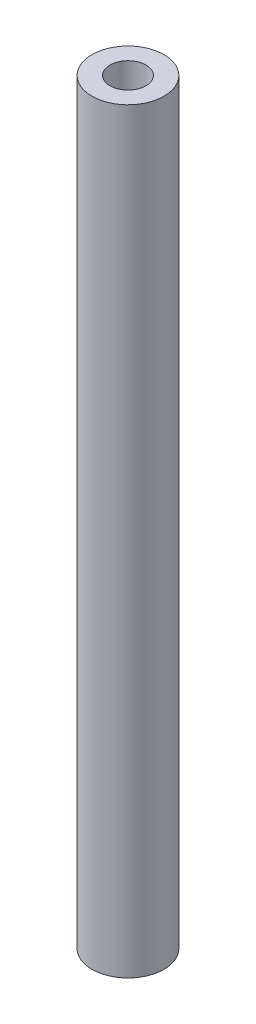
from build123d import *

# Parameters (mm, degrees)
SKETCH1_R           = 2.54
SKETCH1_R_2         = 1.27
BOSS_EXTRUDE1_DEPTH = 53.34


with BuildPart() as part:
    # Sketch1 → Boss-Extrude1 (new body)
    with BuildSketch(Plane(origin=(0, 0, 0), x_dir=(1, 0, 0), z_dir=(0, 1, 0))):
        with Locations(Location((0, 0, 0), (0, 0, 270))):
            Circle(SKETCH1_R)
        with Locations(Location((0, 0, 0), (0, 0, 270))):
            Circle(SKETCH1_R_2, mode=Mode.SUBTRACT)
    extrude(amount=BOSS_EXTRUDE1_DEPTH)


solid = part.part
